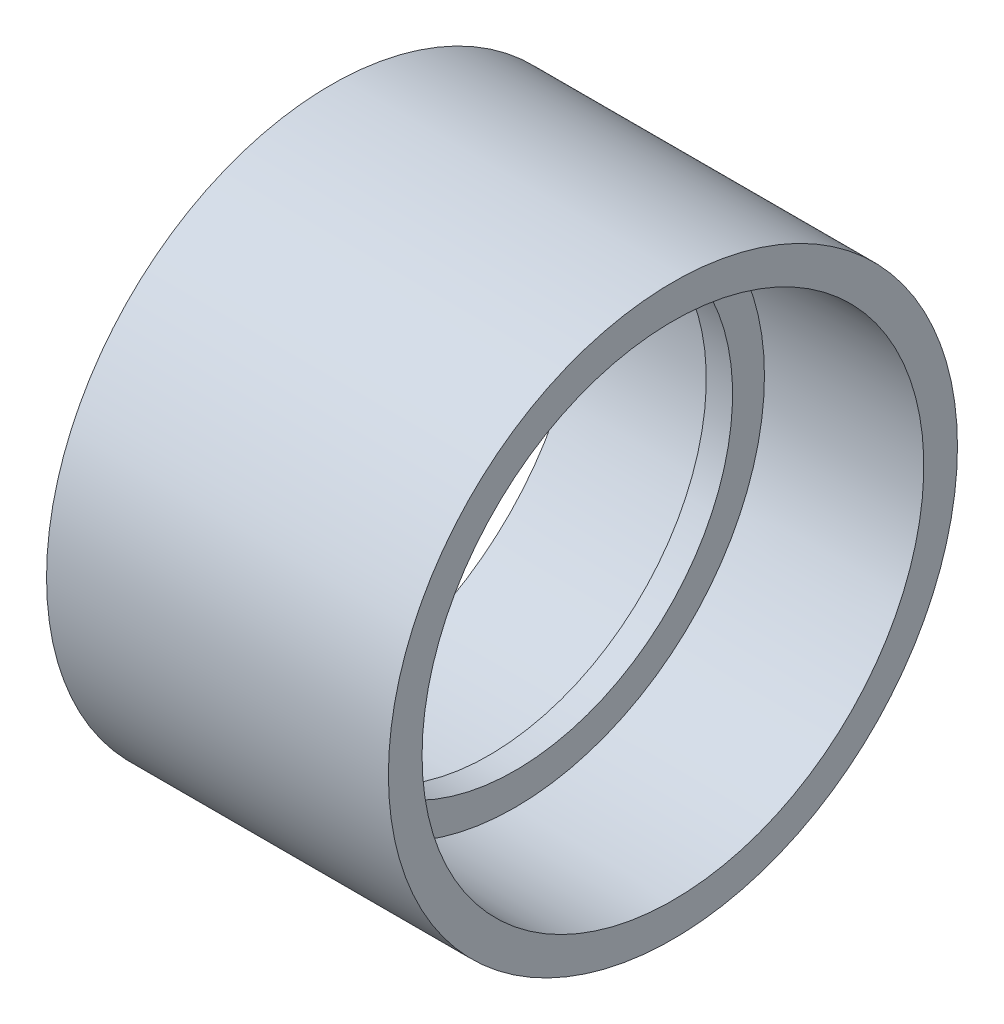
from build123d import *


with BuildPart() as part:
    # Sketch1 → Revolve1 (revolve)
    with BuildSketch(Plane.XY, mode=Mode.PRIVATE) as revolve1_sk:
        Polygon((-20.6375, -34.3535), (20.6375, -34.3535), (20.6375, -30.2895), (1.5875, -30.099), (1.5875, -26.2509), (-1.5875, -26.2509), (-1.5875, -30.099), (-20.6375, -30.2895), align=None)
    revolve(revolve1_sk.sketch.rotate(Axis((-20.6375, 0, 0), (1, 0, 0)), 270), axis=Axis((-20.6375, 0, 0), (1, 0, 0)))


solid = part.part
